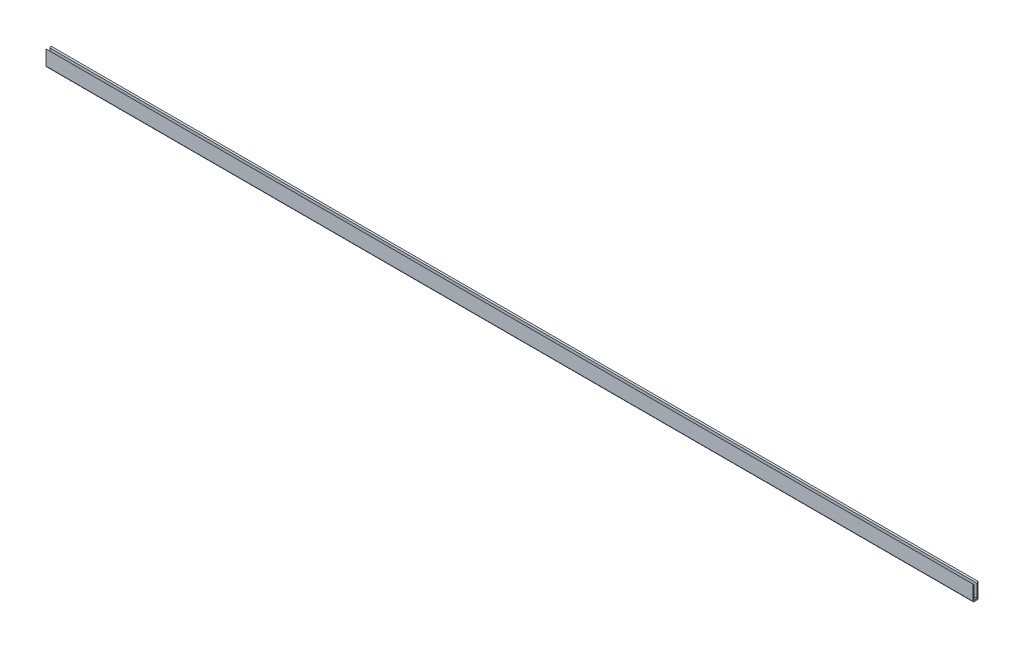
from build123d import *

# Parameters (mm, degrees)
EXTRUDE_1_DEPTH = 1000


with BuildPart() as part:
    # Sketch 2 → Extrude 1 (new body)
    with BuildSketch(Plane(origin=(0, 0, 0), x_dir=(0, 0, -1), z_dir=(1, 0, 0))):
        with BuildLine():
            Line((-1.5, 15.85), (-1.5, 1.5))
            Line((-1.5, 1.5), (1.5, 1.5))
            Line((1.5, 1.5), (1.5, 15.85))
            Line((1.5, 15.85), (2.65, 17))
            Line((2.65, 17), (2.65, 1))
            ThreePointArc((2.65, 1), (2.357106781, 0.292893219), (1.65, 0))
            Line((1.65, 0), (-1.65, 0))
            ThreePointArc((-1.65, 0), (-2.357106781, 0.292893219), (-2.65, 1))
            Line((-2.65, 1), (-2.65, 17))
            Line((-2.65, 17), (-1.5, 15.85))
        make_face()
    extrude(amount=EXTRUDE_1_DEPTH)


solid = part.part
